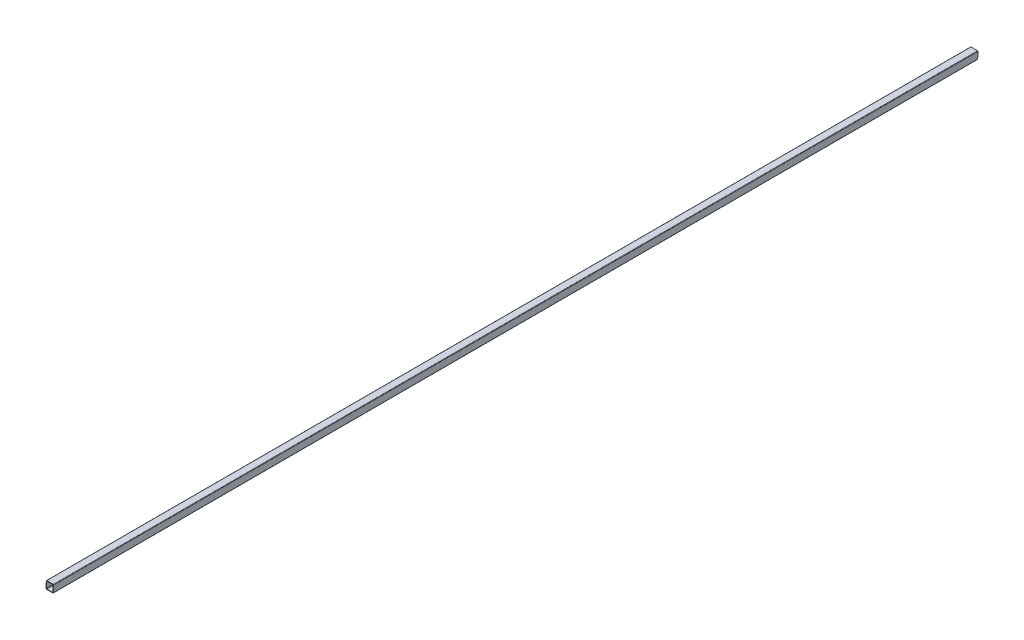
ISO-10303-21;
HEADER;
FILE_DESCRIPTION(('STEP AP214'),'2;1');
FILE_NAME('part.step','',(''),(''),'','','');
FILE_SCHEMA(('AUTOMOTIVE_DESIGN { 1 0 10303 214 1 1 1 1 }'));
ENDSEC;
DATA;
#1=APPLICATION_CONTEXT('core data for automotive mechanical design processes');
#2=APPLICATION_PROTOCOL_DEFINITION('international standard','automotive_design',2000,#1);
#3=PRODUCT_CONTEXT('',#1,'mechanical');
#4=PRODUCT('Part','Part','',(#3));
#5=PRODUCT_RELATED_PRODUCT_CATEGORY('part','',(#4));
#6=PRODUCT_DEFINITION_FORMATION('','',#4);
#7=PRODUCT_DEFINITION_CONTEXT('part definition',#1,'design');
#8=PRODUCT_DEFINITION('design','',#6,#7);
#9=PRODUCT_DEFINITION_SHAPE('','',#8);
#10=(LENGTH_UNIT() NAMED_UNIT(*) SI_UNIT(.MILLI.,.METRE.));
#11=(NAMED_UNIT(*) PLANE_ANGLE_UNIT() SI_UNIT($,.RADIAN.));
#12=(NAMED_UNIT(*) SI_UNIT($,.STERADIAN.) SOLID_ANGLE_UNIT());
#13=UNCERTAINTY_MEASURE_WITH_UNIT(LENGTH_MEASURE(1.E-05),#10,'distance_accuracy_value','');
#14=(GEOMETRIC_REPRESENTATION_CONTEXT(3) GLOBAL_UNCERTAINTY_ASSIGNED_CONTEXT((#13)) GLOBAL_UNIT_ASSIGNED_CONTEXT((#10,
#11,#12)) REPRESENTATION_CONTEXT('',''));
#15=CARTESIAN_POINT('',(0.,0.,0.));
#16=DIRECTION('',(0.,0.,1.));
#17=DIRECTION('',(1.,0.,0.));
#18=AXIS2_PLACEMENT_3D('',#15,#16,#17);
#19=CARTESIAN_POINT('',(-40.,40.,10200.));
#20=DIRECTION('',(1.,0.,0.));
#21=DIRECTION('',(0.,1.,0.));
#22=AXIS2_PLACEMENT_3D('',#19,#20,#21);
#23=PLANE('',#22);
#24=DIRECTION('',(0.,0.,-1.));
#25=VECTOR('',#24,1.);
#26=CARTESIAN_POINT('',(-40.,-35.,10200.));
#27=LINE('',#26,#25);
#28=CARTESIAN_POINT('',(-40.,-35.,3.74999314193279));
#29=VERTEX_POINT('',#28);
#30=CARTESIAN_POINT('',(-40.,-35.,10016.2399931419));
#31=VERTEX_POINT('',#30);
#32=EDGE_CURVE('E189',#29,#31,#27,.F.);
#33=ORIENTED_EDGE('',*,*,#32,.T.);
#34=DIRECTION('',(0.,0.998752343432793,-0.049937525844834));
#35=VECTOR('',#34,1.);
#36=CARTESIAN_POINT('',(-40.,40.,10012.49));
#37=LINE('',#36,#35);
#38=CARTESIAN_POINT('',(-40.,35.,10012.7399995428));
#39=VERTEX_POINT('',#38);
#40=EDGE_CURVE('E166',#31,#39,#37,.T.);
#41=ORIENTED_EDGE('',*,*,#40,.T.);
#42=DIRECTION('',(0.,0.,-1.));
#43=VECTOR('',#42,1.);
#44=CARTESIAN_POINT('',(-40.,35.,10200.));
#45=LINE('',#44,#43);
#46=CARTESIAN_POINT('',(-40.,35.,0.249999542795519));
#47=VERTEX_POINT('',#46);
#48=EDGE_CURVE('E187',#39,#47,#45,.T.);
#49=ORIENTED_EDGE('',*,*,#48,.T.);
#50=DIRECTION('',(0.,-0.998752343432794,0.0499375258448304));
#51=VECTOR('',#50,1.);
#52=CARTESIAN_POINT('',(-40.,40.,0.));
#53=LINE('',#52,#51);
#54=EDGE_CURVE('E223',#47,#29,#53,.T.);
#55=ORIENTED_EDGE('',*,*,#54,.T.);
#56=EDGE_LOOP('',(#33,#41,#49,#55));
#57=FACE_BOUND('',#56,.T.);
#58=ADVANCED_FACE('F38',(#57),#23,.F.);
#59=CARTESIAN_POINT('',(-40.,-40.,10200.));
#60=DIRECTION('',(0.,1.,0.));
#61=DIRECTION('',(0.,0.,1.));
#62=AXIS2_PLACEMENT_3D('',#59,#60,#61);
#63=PLANE('',#62);
#64=DIRECTION('',(0.,0.,-1.));
#65=VECTOR('',#64,1.);
#66=CARTESIAN_POINT('',(35.,-40.,10200.));
#67=LINE('',#66,#65);
#68=CARTESIAN_POINT('',(35.,-40.,3.99999268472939));
#69=VERTEX_POINT('',#68);
#70=CARTESIAN_POINT('',(35.,-40.,10016.4899926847));
#71=VERTEX_POINT('',#70);
#72=EDGE_CURVE('E185',#69,#71,#67,.F.);
#73=ORIENTED_EDGE('',*,*,#72,.T.);
#74=DIRECTION('',(-1.,0.,0.));
#75=VECTOR('',#74,1.);
#76=CARTESIAN_POINT('',(-40.,-40.,10016.4899926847));
#77=LINE('',#76,#75);
#78=CARTESIAN_POINT('',(-35.,-40.,10016.4899926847));
#79=VERTEX_POINT('',#78);
#80=EDGE_CURVE('E151',#71,#79,#77,.T.);
#81=ORIENTED_EDGE('',*,*,#80,.T.);
#82=DIRECTION('',(0.,0.,-1.));
#83=VECTOR('',#82,1.);
#84=CARTESIAN_POINT('',(-35.,-40.,10200.));
#85=LINE('',#84,#83);
#86=CARTESIAN_POINT('',(-35.,-40.,3.99999268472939));
#87=VERTEX_POINT('',#86);
#88=EDGE_CURVE('E183',#79,#87,#85,.T.);
#89=ORIENTED_EDGE('',*,*,#88,.T.);
#90=DIRECTION('',(1.,0.,0.));
#91=VECTOR('',#90,1.);
#92=CARTESIAN_POINT('',(-39.9999999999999,-40.,3.99999268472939));
#93=LINE('',#92,#91);
#94=EDGE_CURVE('E270',#87,#69,#93,.T.);
#95=ORIENTED_EDGE('',*,*,#94,.T.);
#96=EDGE_LOOP('',(#73,#81,#89,#95));
#97=FACE_BOUND('',#96,.T.);
#98=ADVANCED_FACE('F306',(#97),#63,.F.);
#99=CARTESIAN_POINT('',(40.,40.,10200.));
#100=DIRECTION('',(-1.,0.,0.));
#101=DIRECTION('',(0.,-1.,0.));
#102=AXIS2_PLACEMENT_3D('',#99,#100,#101);
#103=PLANE('',#102);
#104=DIRECTION('',(0.,0.,-1.));
#105=VECTOR('',#104,1.);
#106=CARTESIAN_POINT('',(40.,35.,10200.));
#107=LINE('',#106,#105);
#108=CARTESIAN_POINT('',(40.,35.,0.24999954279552));
#109=VERTEX_POINT('',#108);
#110=CARTESIAN_POINT('',(40.,35.,10012.7399995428));
#111=VERTEX_POINT('',#110);
#112=EDGE_CURVE('E165',#109,#111,#107,.F.);
#113=ORIENTED_EDGE('',*,*,#112,.T.);
#114=DIRECTION('',(0.,0.998752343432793,-0.049937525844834));
#115=VECTOR('',#114,1.);
#116=CARTESIAN_POINT('',(40.,40.,10012.49));
#117=LINE('',#116,#115);
#118=CARTESIAN_POINT('',(40.,-35.,10016.2399931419));
#119=VERTEX_POINT('',#118);
#120=EDGE_CURVE('E60',#119,#111,#117,.T.);
#121=ORIENTED_EDGE('',*,*,#120,.F.);
#122=DIRECTION('',(0.,0.,-1.));
#123=VECTOR('',#122,1.);
#124=CARTESIAN_POINT('',(40.,-35.,10200.));
#125=LINE('',#124,#123);
#126=CARTESIAN_POINT('',(40.,-35.,3.7499931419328));
#127=VERTEX_POINT('',#126);
#128=EDGE_CURVE('E162',#119,#127,#125,.T.);
#129=ORIENTED_EDGE('',*,*,#128,.T.);
#130=DIRECTION('',(0.,-0.998752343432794,0.0499375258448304));
#131=VECTOR('',#130,1.);
#132=CARTESIAN_POINT('',(40.,40.,0.));
#133=LINE('',#132,#131);
#134=EDGE_CURVE('E262',#109,#127,#133,.T.);
#135=ORIENTED_EDGE('',*,*,#134,.F.);
#136=EDGE_LOOP('',(#113,#121,#129,#135));
#137=FACE_BOUND('',#136,.T.);
#138=ADVANCED_FACE('F160',(#137),#103,.F.);
#139=CARTESIAN_POINT('',(-40.,40.,10200.));
#140=DIRECTION('',(0.,-1.,0.));
#141=DIRECTION('',(0.,0.,-1.));
#142=AXIS2_PLACEMENT_3D('',#139,#140,#141);
#143=PLANE('',#142);
#144=DIRECTION('',(0.,0.,-1.));
#145=VECTOR('',#144,1.);
#146=CARTESIAN_POINT('',(-35.,40.,10200.));
#147=LINE('',#146,#145);
#148=CARTESIAN_POINT('',(-35.,40.,0.));
#149=VERTEX_POINT('',#148);
#150=CARTESIAN_POINT('',(-35.,40.,10012.49));
#151=VERTEX_POINT('',#150);
#152=EDGE_CURVE('E194',#149,#151,#147,.F.);
#153=ORIENTED_EDGE('',*,*,#152,.T.);
#154=DIRECTION('',(1.,0.,0.));
#155=VECTOR('',#154,1.);
#156=CARTESIAN_POINT('',(-40.,40.,10012.49));
#157=LINE('',#156,#155);
#158=CARTESIAN_POINT('',(35.,40.,10012.49));
#159=VERTEX_POINT('',#158);
#160=EDGE_CURVE('E431',#151,#159,#157,.T.);
#161=ORIENTED_EDGE('',*,*,#160,.T.);
#162=DIRECTION('',(0.,0.,-1.));
#163=VECTOR('',#162,1.);
#164=CARTESIAN_POINT('',(35.,40.,10200.));
#165=LINE('',#164,#163);
#166=CARTESIAN_POINT('',(35.,40.,0.));
#167=VERTEX_POINT('',#166);
#168=EDGE_CURVE('E192',#159,#167,#165,.T.);
#169=ORIENTED_EDGE('',*,*,#168,.T.);
#170=DIRECTION('',(-1.,0.,0.));
#171=VECTOR('',#170,1.);
#172=CARTESIAN_POINT('',(-40.,40.,0.));
#173=LINE('',#172,#171);
#174=EDGE_CURVE('E273',#167,#149,#173,.T.);
#175=ORIENTED_EDGE('',*,*,#174,.T.);
#176=EDGE_LOOP('',(#153,#161,#169,#175));
#177=FACE_BOUND('',#176,.T.);
#178=ADVANCED_FACE('F333',(#177),#143,.F.);
#179=CARTESIAN_POINT('',(-35.,35.,10200.));
#180=DIRECTION('',(1.,0.,0.));
#181=DIRECTION('',(0.,1.,0.));
#182=AXIS2_PLACEMENT_3D('',#179,#180,#181);
#183=PLANE('',#182);
#184=DIRECTION('',(0.,0.998752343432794,-0.049937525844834));
#185=VECTOR('',#184,1.);
#186=CARTESIAN_POINT('',(-35.,25.6603660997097,10013.2069803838));
#187=LINE('',#186,#185);
#188=CARTESIAN_POINT('',(-35.,-30.,10015.9899935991));
#189=VERTEX_POINT('',#188);
#190=CARTESIAN_POINT('',(-35.,30.0000000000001,10012.9899990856));
#191=VERTEX_POINT('',#190);
#192=EDGE_CURVE('E257',#189,#191,#187,.T.);
#193=ORIENTED_EDGE('',*,*,#192,.F.);
#194=DIRECTION('',(0.,0.,-1.));
#195=VECTOR('',#194,1.);
#196=CARTESIAN_POINT('',(-35.,-30.,3.74999314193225));
#197=LINE('',#196,#195);
#198=CARTESIAN_POINT('',(-35.,-29.9999999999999,3.49999359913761));
#199=VERTEX_POINT('',#198);
#200=EDGE_CURVE('E280',#189,#199,#197,.T.);
#201=ORIENTED_EDGE('',*,*,#200,.T.);
#202=DIRECTION('',(0.,-0.998752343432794,0.0499375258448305));
#203=VECTOR('',#202,1.);
#204=CARTESIAN_POINT('',(-35.,-473.714785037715,25.6856922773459));
#205=LINE('',#204,#203);
#206=CARTESIAN_POINT('',(-35.,30.0000000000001,0.499999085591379));
#207=VERTEX_POINT('',#206);
#208=EDGE_CURVE('E267',#207,#199,#205,.T.);
#209=ORIENTED_EDGE('',*,*,#208,.F.);
#210=DIRECTION('',(0.,0.,-1.));
#211=VECTOR('',#210,1.);
#212=CARTESIAN_POINT('',(-35.,30.,10200.));
#213=LINE('',#212,#211);
#214=EDGE_CURVE('E277',#207,#191,#213,.F.);
#215=ORIENTED_EDGE('',*,*,#214,.T.);
#216=EDGE_LOOP('',(#193,#201,#209,#215));
#217=FACE_BOUND('',#216,.T.);
#218=ADVANCED_FACE('F292',(#217),#183,.T.);
#219=CARTESIAN_POINT('',(-35.,-35.,10200.));
#220=DIRECTION('',(0.,1.,0.));
#221=DIRECTION('',(0.,0.,1.));
#222=AXIS2_PLACEMENT_3D('',#219,#220,#221);
#223=PLANE('',#222);
#224=DIRECTION('',(-1.,0.,0.));
#225=VECTOR('',#224,1.);
#226=CARTESIAN_POINT('',(-35.,-35.,10016.2399931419));
#227=LINE('',#226,#225);
#228=CARTESIAN_POINT('',(30.,-35.,10016.2399931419));
#229=VERTEX_POINT('',#228);
#230=CARTESIAN_POINT('',(-30.,-35.,10016.2399931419));
#231=VERTEX_POINT('',#230);
#232=EDGE_CURVE('E249',#229,#231,#227,.T.);
#233=ORIENTED_EDGE('',*,*,#232,.F.);
#234=DIRECTION('',(0.,0.,-1.));
#235=VECTOR('',#234,1.);
#236=CARTESIAN_POINT('',(30.,-35.,3.74999314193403));
#237=LINE('',#236,#235);
#238=CARTESIAN_POINT('',(30.,-35.,3.74999314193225));
#239=VERTEX_POINT('',#238);
#240=EDGE_CURVE('E231',#229,#239,#237,.T.);
#241=ORIENTED_EDGE('',*,*,#240,.T.);
#242=DIRECTION('',(1.,0.,0.));
#243=VECTOR('',#242,1.);
#244=CARTESIAN_POINT('',(-34.9999999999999,-35.,3.74999314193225));
#245=LINE('',#244,#243);
#246=CARTESIAN_POINT('',(-30.,-35.,3.74999314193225));
#247=VERTEX_POINT('',#246);
#248=EDGE_CURVE('E212',#247,#239,#245,.T.);
#249=ORIENTED_EDGE('',*,*,#248,.F.);
#250=DIRECTION('',(0.,0.,-1.));
#251=VECTOR('',#250,1.);
#252=CARTESIAN_POINT('',(-30.,-35.,10200.));
#253=LINE('',#252,#251);
#254=EDGE_CURVE('E226',#247,#231,#253,.F.);
#255=ORIENTED_EDGE('',*,*,#254,.T.);
#256=EDGE_LOOP('',(#233,#241,#249,#255));
#257=FACE_BOUND('',#256,.T.);
#258=ADVANCED_FACE('F283',(#257),#223,.T.);
#259=CARTESIAN_POINT('',(35.,35.,10200.));
#260=DIRECTION('',(-1.,0.,0.));
#261=DIRECTION('',(0.,-1.,0.));
#262=AXIS2_PLACEMENT_3D('',#259,#260,#261);
#263=PLANE('',#262);
#264=DIRECTION('',(0.,-0.998752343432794,0.049937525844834));
#265=VECTOR('',#264,1.);
#266=CARTESIAN_POINT('',(35.,25.6603660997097,10013.2069803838));
#267=LINE('',#266,#265);
#268=CARTESIAN_POINT('',(35.,30.0000000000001,10012.9899990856));
#269=VERTEX_POINT('',#268);
#270=CARTESIAN_POINT('',(35.,-30.,10015.9899935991));
#271=VERTEX_POINT('',#270);
#272=EDGE_CURVE('E53',#269,#271,#267,.T.);
#273=ORIENTED_EDGE('',*,*,#272,.F.);
#274=DIRECTION('',(0.,0.,-1.));
#275=VECTOR('',#274,1.);
#276=CARTESIAN_POINT('',(35.,30.,0.249999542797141));
#277=LINE('',#276,#275);
#278=CARTESIAN_POINT('',(35.,30.0000000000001,0.499999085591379));
#279=VERTEX_POINT('',#278);
#280=EDGE_CURVE('E221',#269,#279,#277,.T.);
#281=ORIENTED_EDGE('',*,*,#280,.T.);
#282=DIRECTION('',(0.,0.998752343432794,-0.0499375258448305));
#283=VECTOR('',#282,1.);
#284=CARTESIAN_POINT('',(35.0000000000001,-473.714785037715,25.6856922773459));
#285=LINE('',#284,#283);
#286=CARTESIAN_POINT('',(35.,-29.9999999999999,3.49999359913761));
#287=VERTEX_POINT('',#286);
#288=EDGE_CURVE('E210',#287,#279,#285,.T.);
#289=ORIENTED_EDGE('',*,*,#288,.F.);
#290=DIRECTION('',(0.,0.,-1.));
#291=VECTOR('',#290,1.);
#292=CARTESIAN_POINT('',(35.,-30.,10200.));
#293=LINE('',#292,#291);
#294=EDGE_CURVE('E219',#287,#271,#293,.F.);
#295=ORIENTED_EDGE('',*,*,#294,.T.);
#296=EDGE_LOOP('',(#273,#281,#289,#295));
#297=FACE_BOUND('',#296,.T.);
#298=ADVANCED_FACE('F218',(#297),#263,.T.);
#299=CARTESIAN_POINT('',(-35.,35.,10200.));
#300=DIRECTION('',(0.,-1.,0.));
#301=DIRECTION('',(0.,0.,-1.));
#302=AXIS2_PLACEMENT_3D('',#299,#300,#301);
#303=PLANE('',#302);
#304=DIRECTION('',(1.,0.,0.));
#305=VECTOR('',#304,1.);
#306=CARTESIAN_POINT('',(-35.,35.,10012.7399995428));
#307=LINE('',#306,#305);
#308=CARTESIAN_POINT('',(-30.,35.,10012.7399995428));
#309=VERTEX_POINT('',#308);
#310=CARTESIAN_POINT('',(30.,35.,10012.7399995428));
#311=VERTEX_POINT('',#310);
#312=EDGE_CURVE('E241',#309,#311,#307,.T.);
#313=ORIENTED_EDGE('',*,*,#312,.F.);
#314=DIRECTION('',(0.,0.,-1.));
#315=VECTOR('',#314,1.);
#316=CARTESIAN_POINT('',(-30.,35.,0.249999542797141));
#317=LINE('',#316,#315);
#318=CARTESIAN_POINT('',(-30.,35.,0.249999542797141));
#319=VERTEX_POINT('',#318);
#320=EDGE_CURVE('E228',#309,#319,#317,.T.);
#321=ORIENTED_EDGE('',*,*,#320,.T.);
#322=DIRECTION('',(-1.,0.,0.));
#323=VECTOR('',#322,1.);
#324=CARTESIAN_POINT('',(-34.9999999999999,35.,0.249999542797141));
#325=LINE('',#324,#323);
#326=CARTESIAN_POINT('',(30.,35.,0.249999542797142));
#327=VERTEX_POINT('',#326);
#328=EDGE_CURVE('E243',#327,#319,#325,.T.);
#329=ORIENTED_EDGE('',*,*,#328,.F.);
#330=DIRECTION('',(0.,0.,-1.));
#331=VECTOR('',#330,1.);
#332=CARTESIAN_POINT('',(30.,35.,10200.));
#333=LINE('',#332,#331);
#334=EDGE_CURVE('E175',#327,#311,#333,.F.);
#335=ORIENTED_EDGE('',*,*,#334,.T.);
#336=EDGE_LOOP('',(#313,#321,#329,#335));
#337=FACE_BOUND('',#336,.T.);
#338=ADVANCED_FACE('F240',(#337),#303,.T.);
#339=CARTESIAN_POINT('',(-40.,40.,0.));
#340=DIRECTION('',(0.,0.0499375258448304,0.998752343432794));
#341=DIRECTION('',(0.,-0.998752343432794,0.0499375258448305));
#342=AXIS2_PLACEMENT_3D('',#339,#340,#341);
#343=PLANE('',#342);
#344=ORIENTED_EDGE('',*,*,#328,.T.);
#345=CARTESIAN_POINT('',(-30.,30.,0.49999908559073));
#346=DIRECTION('',(0.,0.0499375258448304,0.998752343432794));
#347=DIRECTION('',(0.,-0.998752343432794,0.0499375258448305));
#348=AXIS2_PLACEMENT_3D('',#345,#346,#347);
#349=ELLIPSE('',#348,5.00624607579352,5.);
#350=EDGE_CURVE('E201',#319,#207,#349,.T.);
#351=ORIENTED_EDGE('',*,*,#350,.T.);
#352=ORIENTED_EDGE('',*,*,#208,.T.);
#353=CARTESIAN_POINT('',(-30.,-30.,3.49999359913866));
#354=DIRECTION('',(0.,0.0499375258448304,0.998752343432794));
#355=DIRECTION('',(0.,-0.998752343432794,0.0499375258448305));
#356=AXIS2_PLACEMENT_3D('',#353,#354,#355);
#357=ELLIPSE('',#356,5.00624607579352,5.);
#358=EDGE_CURVE('E197',#199,#247,#357,.T.);
#359=ORIENTED_EDGE('',*,*,#358,.T.);
#360=ORIENTED_EDGE('',*,*,#248,.T.);
#361=CARTESIAN_POINT('',(30.,-30.,3.49999359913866));
#362=DIRECTION('',(0.,0.0499375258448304,0.998752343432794));
#363=DIRECTION('',(0.,-0.998752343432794,0.0499375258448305));
#364=AXIS2_PLACEMENT_3D('',#361,#362,#363);
#365=ELLIPSE('',#364,5.00624607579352,5.);
#366=EDGE_CURVE('E46',#239,#287,#365,.T.);
#367=ORIENTED_EDGE('',*,*,#366,.T.);
#368=ORIENTED_EDGE('',*,*,#288,.T.);
#369=CARTESIAN_POINT('',(30.,30.,0.49999908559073));
#370=DIRECTION('',(0.,0.0499375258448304,0.998752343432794));
#371=DIRECTION('',(0.,-0.998752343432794,0.0499375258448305));
#372=AXIS2_PLACEMENT_3D('',#369,#370,#371);
#373=ELLIPSE('',#372,5.00624607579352,5.);
#374=EDGE_CURVE('E199',#279,#327,#373,.T.);
#375=ORIENTED_EDGE('',*,*,#374,.T.);
#376=EDGE_LOOP('',(#344,#351,#352,#359,#360,#367,#368,#375));
#377=FACE_BOUND('',#376,.T.);
#378=ORIENTED_EDGE('',*,*,#134,.T.);
#379=CARTESIAN_POINT('',(35.,-35.,3.74999314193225));
#380=DIRECTION('',(0.,0.0499375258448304,0.998752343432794));
#381=DIRECTION('',(0.,0.998752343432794,-0.0499375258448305));
#382=AXIS2_PLACEMENT_3D('',#379,#380,#381);
#383=ELLIPSE('',#382,5.00624607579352,5.);
#384=EDGE_CURVE('E169',#127,#69,#383,.F.);
#385=ORIENTED_EDGE('',*,*,#384,.T.);
#386=ORIENTED_EDGE('',*,*,#94,.F.);
#387=CARTESIAN_POINT('',(-35.,-35.,3.74999314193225));
#388=DIRECTION('',(0.,0.0499375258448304,0.998752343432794));
#389=DIRECTION('',(0.,0.998752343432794,-0.0499375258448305));
#390=AXIS2_PLACEMENT_3D('',#387,#388,#389);
#391=ELLIPSE('',#390,5.00624607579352,5.);
#392=EDGE_CURVE('E180',#87,#29,#391,.F.);
#393=ORIENTED_EDGE('',*,*,#392,.T.);
#394=ORIENTED_EDGE('',*,*,#54,.F.);
#395=CARTESIAN_POINT('',(-35.,35.,0.249999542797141));
#396=DIRECTION('',(0.,0.0499375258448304,0.998752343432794));
#397=DIRECTION('',(0.,0.998752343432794,-0.0499375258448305));
#398=AXIS2_PLACEMENT_3D('',#395,#396,#397);
#399=ELLIPSE('',#398,5.00624607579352,5.);
#400=EDGE_CURVE('E173',#47,#149,#399,.F.);
#401=ORIENTED_EDGE('',*,*,#400,.T.);
#402=ORIENTED_EDGE('',*,*,#174,.F.);
#403=CARTESIAN_POINT('',(35.,35.,0.249999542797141));
#404=DIRECTION('',(0.,0.0499375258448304,0.998752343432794));
#405=DIRECTION('',(0.,0.998752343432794,-0.0499375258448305));
#406=AXIS2_PLACEMENT_3D('',#403,#404,#405);
#407=ELLIPSE('',#406,5.00624607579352,5.);
#408=EDGE_CURVE('E171',#167,#109,#407,.F.);
#409=ORIENTED_EDGE('',*,*,#408,.T.);
#410=EDGE_LOOP('',(#378,#385,#386,#393,#394,#401,#402,#409));
#411=FACE_BOUND('',#410,.T.);
#412=ADVANCED_FACE('F208',(#377,#411),#343,.F.);
#413=CARTESIAN_POINT('',(-30.,-30.,10200.));
#414=DIRECTION('',(0.,0.,1.));
#415=DIRECTION('',(1.,0.,0.));
#416=AXIS2_PLACEMENT_3D('',#413,#414,#415);
#417=CYLINDRICAL_SURFACE('',#416,5.);
#418=ORIENTED_EDGE('',*,*,#200,.F.);
#419=CARTESIAN_POINT('',(-30.,-30.,10015.9899935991));
#420=DIRECTION('',(0.,-0.049937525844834,-0.998752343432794));
#421=DIRECTION('',(0.,-0.998752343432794,0.049937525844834));
#422=AXIS2_PLACEMENT_3D('',#419,#420,#421);
#423=ELLIPSE('',#422,5.00624607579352,5.);
#424=EDGE_CURVE('E248',#189,#231,#423,.F.);
#425=ORIENTED_EDGE('',*,*,#424,.T.);
#426=ORIENTED_EDGE('',*,*,#254,.F.);
#427=ORIENTED_EDGE('',*,*,#358,.F.);
#428=EDGE_LOOP('',(#418,#425,#426,#427));
#429=FACE_BOUND('',#428,.T.);
#430=ADVANCED_FACE('F288',(#429),#417,.F.);
#431=CARTESIAN_POINT('',(30.,30.,10200.));
#432=DIRECTION('',(0.,0.,1.));
#433=DIRECTION('',(1.,0.,0.));
#434=AXIS2_PLACEMENT_3D('',#431,#432,#433);
#435=CYLINDRICAL_SURFACE('',#434,5.);
#436=ORIENTED_EDGE('',*,*,#280,.F.);
#437=CARTESIAN_POINT('',(30.,30.,10012.9899990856));
#438=DIRECTION('',(0.,-0.049937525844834,-0.998752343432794));
#439=DIRECTION('',(0.,-0.998752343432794,0.049937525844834));
#440=AXIS2_PLACEMENT_3D('',#437,#438,#439);
#441=ELLIPSE('',#440,5.00624607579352,5.);
#442=EDGE_CURVE('E247',#269,#311,#441,.F.);
#443=ORIENTED_EDGE('',*,*,#442,.T.);
#444=ORIENTED_EDGE('',*,*,#334,.F.);
#445=ORIENTED_EDGE('',*,*,#374,.F.);
#446=EDGE_LOOP('',(#436,#443,#444,#445));
#447=FACE_BOUND('',#446,.T.);
#448=ADVANCED_FACE('F246',(#447),#435,.F.);
#449=CARTESIAN_POINT('',(-30.,30.,10200.));
#450=DIRECTION('',(0.,0.,1.));
#451=DIRECTION('',(1.,0.,0.));
#452=AXIS2_PLACEMENT_3D('',#449,#450,#451);
#453=CYLINDRICAL_SURFACE('',#452,5.);
#454=ORIENTED_EDGE('',*,*,#320,.F.);
#455=CARTESIAN_POINT('',(-30.,30.,10012.9899990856));
#456=DIRECTION('',(0.,-0.049937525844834,-0.998752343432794));
#457=DIRECTION('',(0.,-0.998752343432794,0.049937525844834));
#458=AXIS2_PLACEMENT_3D('',#455,#456,#457);
#459=ELLIPSE('',#458,5.00624607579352,5.);
#460=EDGE_CURVE('E259',#309,#191,#459,.F.);
#461=ORIENTED_EDGE('',*,*,#460,.T.);
#462=ORIENTED_EDGE('',*,*,#214,.F.);
#463=ORIENTED_EDGE('',*,*,#350,.F.);
#464=EDGE_LOOP('',(#454,#461,#462,#463));
#465=FACE_BOUND('',#464,.T.);
#466=ADVANCED_FACE('F295',(#465),#453,.F.);
#467=CARTESIAN_POINT('',(30.,-30.,10200.));
#468=DIRECTION('',(0.,0.,1.));
#469=DIRECTION('',(1.,0.,0.));
#470=AXIS2_PLACEMENT_3D('',#467,#468,#469);
#471=CYLINDRICAL_SURFACE('',#470,5.);
#472=ORIENTED_EDGE('',*,*,#240,.F.);
#473=CARTESIAN_POINT('',(30.,-30.,10015.9899935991));
#474=DIRECTION('',(0.,-0.049937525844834,-0.998752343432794));
#475=DIRECTION('',(0.,-0.998752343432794,0.049937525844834));
#476=AXIS2_PLACEMENT_3D('',#473,#474,#475);
#477=ELLIPSE('',#476,5.00624607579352,5.);
#478=EDGE_CURVE('E156',#229,#271,#477,.F.);
#479=ORIENTED_EDGE('',*,*,#478,.T.);
#480=ORIENTED_EDGE('',*,*,#294,.F.);
#481=ORIENTED_EDGE('',*,*,#366,.F.);
#482=EDGE_LOOP('',(#472,#479,#480,#481));
#483=FACE_BOUND('',#482,.T.);
#484=ADVANCED_FACE('F225',(#483),#471,.F.);
#485=CARTESIAN_POINT('',(35.,-35.,10200.));
#486=DIRECTION('',(0.,0.,-1.));
#487=DIRECTION('',(-1.,0.,0.));
#488=AXIS2_PLACEMENT_3D('',#485,#486,#487);
#489=CYLINDRICAL_SURFACE('',#488,5.);
#490=CARTESIAN_POINT('',(35.,-35.,10016.2399931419));
#491=DIRECTION('',(0.,-0.049937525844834,-0.998752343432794));
#492=DIRECTION('',(0.,0.998752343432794,-0.049937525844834));
#493=AXIS2_PLACEMENT_3D('',#490,#491,#492);
#494=ELLIPSE('',#493,5.00624607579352,5.);
#495=EDGE_CURVE('E148',#71,#119,#494,.F.);
#496=ORIENTED_EDGE('',*,*,#495,.F.);
#497=ORIENTED_EDGE('',*,*,#72,.F.);
#498=ORIENTED_EDGE('',*,*,#384,.F.);
#499=ORIENTED_EDGE('',*,*,#128,.F.);
#500=EDGE_LOOP('',(#496,#497,#498,#499));
#501=FACE_BOUND('',#500,.T.);
#502=ADVANCED_FACE('F168',(#501),#489,.T.);
#503=CARTESIAN_POINT('',(-35.,-35.,10200.));
#504=DIRECTION('',(0.,0.,-1.));
#505=DIRECTION('',(-1.,0.,0.));
#506=AXIS2_PLACEMENT_3D('',#503,#504,#505);
#507=CYLINDRICAL_SURFACE('',#506,5.);
#508=CARTESIAN_POINT('',(-35.,-35.,10016.2399931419));
#509=DIRECTION('',(0.,-0.049937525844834,-0.998752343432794));
#510=DIRECTION('',(0.,0.998752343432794,-0.049937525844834));
#511=AXIS2_PLACEMENT_3D('',#508,#509,#510);
#512=ELLIPSE('',#511,5.00624607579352,5.);
#513=EDGE_CURVE('E436',#31,#79,#512,.F.);
#514=ORIENTED_EDGE('',*,*,#513,.F.);
#515=ORIENTED_EDGE('',*,*,#32,.F.);
#516=ORIENTED_EDGE('',*,*,#392,.F.);
#517=ORIENTED_EDGE('',*,*,#88,.F.);
#518=EDGE_LOOP('',(#514,#515,#516,#517));
#519=FACE_BOUND('',#518,.T.);
#520=ADVANCED_FACE('F391',(#519),#507,.T.);
#521=CARTESIAN_POINT('',(-35.,35.,10200.));
#522=DIRECTION('',(0.,0.,-1.));
#523=DIRECTION('',(-1.,0.,0.));
#524=AXIS2_PLACEMENT_3D('',#521,#522,#523);
#525=CYLINDRICAL_SURFACE('',#524,5.);
#526=CARTESIAN_POINT('',(-35.,35.,10012.7399995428));
#527=DIRECTION('',(0.,-0.049937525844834,-0.998752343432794));
#528=DIRECTION('',(0.,0.998752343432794,-0.049937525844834));
#529=AXIS2_PLACEMENT_3D('',#526,#527,#528);
#530=ELLIPSE('',#529,5.00624607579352,5.);
#531=EDGE_CURVE('E434',#151,#39,#530,.F.);
#532=ORIENTED_EDGE('',*,*,#531,.F.);
#533=ORIENTED_EDGE('',*,*,#152,.F.);
#534=ORIENTED_EDGE('',*,*,#400,.F.);
#535=ORIENTED_EDGE('',*,*,#48,.F.);
#536=EDGE_LOOP('',(#532,#533,#534,#535));
#537=FACE_BOUND('',#536,.T.);
#538=ADVANCED_FACE('F400',(#537),#525,.T.);
#539=CARTESIAN_POINT('',(35.,35.,10200.));
#540=DIRECTION('',(0.,0.,-1.));
#541=DIRECTION('',(-1.,0.,0.));
#542=AXIS2_PLACEMENT_3D('',#539,#540,#541);
#543=CYLINDRICAL_SURFACE('',#542,5.);
#544=CARTESIAN_POINT('',(35.,35.,10012.7399995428));
#545=DIRECTION('',(0.,-0.049937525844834,-0.998752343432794));
#546=DIRECTION('',(0.,0.998752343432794,-0.049937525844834));
#547=AXIS2_PLACEMENT_3D('',#544,#545,#546);
#548=ELLIPSE('',#547,5.00624607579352,5.);
#549=EDGE_CURVE('E11',#111,#159,#548,.F.);
#550=ORIENTED_EDGE('',*,*,#549,.F.);
#551=ORIENTED_EDGE('',*,*,#112,.F.);
#552=ORIENTED_EDGE('',*,*,#408,.F.);
#553=ORIENTED_EDGE('',*,*,#168,.F.);
#554=EDGE_LOOP('',(#550,#551,#552,#553));
#555=FACE_BOUND('',#554,.T.);
#556=ADVANCED_FACE('F40',(#555),#543,.T.);
#557=CARTESIAN_POINT('',(-40.,40.,10012.49));
#558=DIRECTION('',(0.,-0.049937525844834,-0.998752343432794));
#559=DIRECTION('',(0.,0.998752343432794,-0.049937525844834));
#560=AXIS2_PLACEMENT_3D('',#557,#558,#559);
#561=PLANE('',#560);
#562=ORIENTED_EDGE('',*,*,#495,.T.);
#563=ORIENTED_EDGE('',*,*,#120,.T.);
#564=ORIENTED_EDGE('',*,*,#549,.T.);
#565=ORIENTED_EDGE('',*,*,#160,.F.);
#566=ORIENTED_EDGE('',*,*,#531,.T.);
#567=ORIENTED_EDGE('',*,*,#40,.F.);
#568=ORIENTED_EDGE('',*,*,#513,.T.);
#569=ORIENTED_EDGE('',*,*,#80,.F.);
#570=EDGE_LOOP('',(#562,#563,#564,#565,#566,#567,#568,#569));
#571=FACE_BOUND('',#570,.T.);
#572=ORIENTED_EDGE('',*,*,#312,.T.);
#573=ORIENTED_EDGE('',*,*,#442,.F.);
#574=ORIENTED_EDGE('',*,*,#272,.T.);
#575=ORIENTED_EDGE('',*,*,#478,.F.);
#576=ORIENTED_EDGE('',*,*,#232,.T.);
#577=ORIENTED_EDGE('',*,*,#424,.F.);
#578=ORIENTED_EDGE('',*,*,#192,.T.);
#579=ORIENTED_EDGE('',*,*,#460,.F.);
#580=EDGE_LOOP('',(#572,#573,#574,#575,#576,#577,#578,#579));
#581=FACE_BOUND('',#580,.T.);
#582=ADVANCED_FACE('F149',(#571,#581),#561,.F.);
#583=CLOSED_SHELL('',(#58,#98,#138,#178,#218,#258,#298,#338,#412,#430,#448,#466,#484,#502,#520,
#538,#556,#582));
#584=MANIFOLD_SOLID_BREP('B2',#583);
#585=ADVANCED_BREP_SHAPE_REPRESENTATION('',(#18,#584),#14);
#586=SHAPE_DEFINITION_REPRESENTATION(#9,#585);
ENDSEC;
END-ISO-10303-21;
